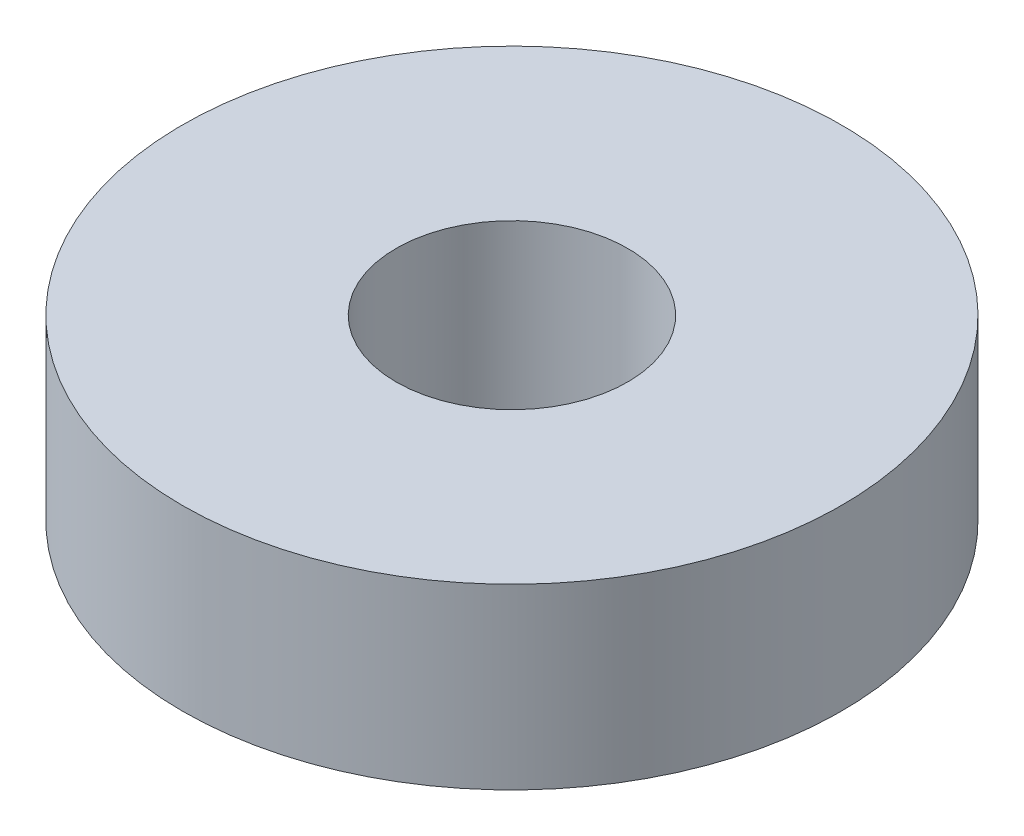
from build123d import *

# Parameters (mm, degrees)
SKETCH1_R           = 9.398
SKETCH1_R_2         = 3.302
BOSS_EXTRUDE1_DEPTH = 5.08


with BuildPart() as part:
    # Sketch1 → Boss-Extrude1 (new body)
    with BuildSketch(Plane(origin=(0, 0, 0), x_dir=(1, 0, 0), z_dir=(0, 1, 0))):
        with Locations(Location((0, 0, 0), (0, 0, 270))):
            Circle(SKETCH1_R)
        with Locations(Location((0, 0, 0), (0, 0, 270))):
            Circle(SKETCH1_R_2, mode=Mode.SUBTRACT)
    extrude(amount=BOSS_EXTRUDE1_DEPTH)


solid = part.part
